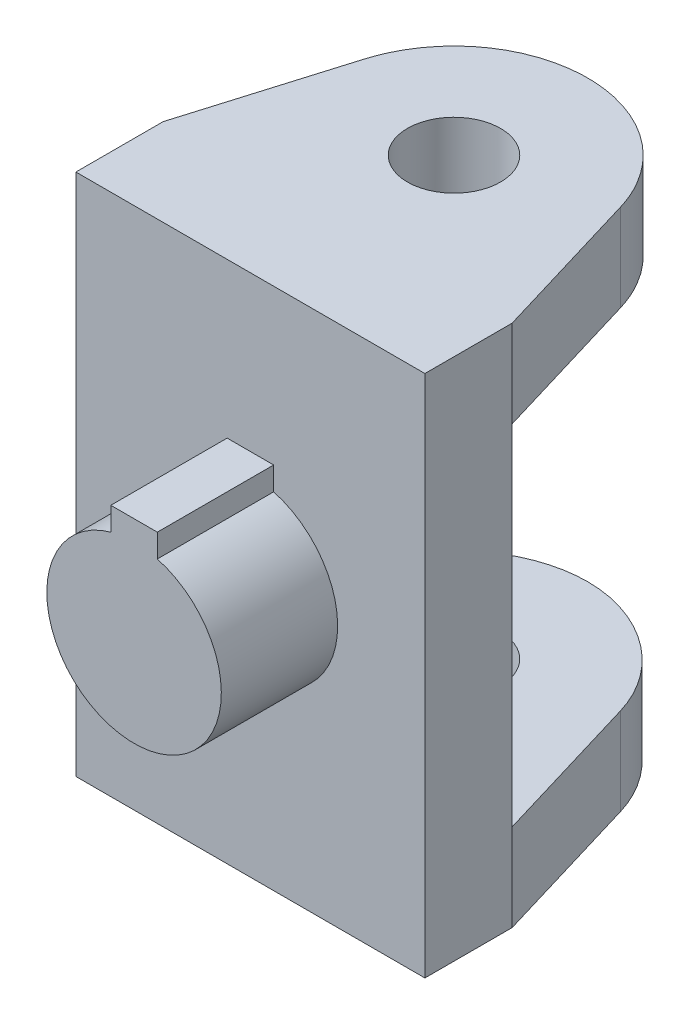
ISO-10303-21;
HEADER;
FILE_DESCRIPTION(('STEP AP214'),'2;1');
FILE_NAME('part.step','',(''),(''),'','','');
FILE_SCHEMA(('AUTOMOTIVE_DESIGN { 1 0 10303 214 1 1 1 1 }'));
ENDSEC;
DATA;
#1=APPLICATION_CONTEXT('core data for automotive mechanical design processes');
#2=APPLICATION_PROTOCOL_DEFINITION('international standard','automotive_design',2000,#1);
#3=PRODUCT_CONTEXT('',#1,'mechanical');
#4=PRODUCT('Part','Part','',(#3));
#5=PRODUCT_RELATED_PRODUCT_CATEGORY('part','',(#4));
#6=PRODUCT_DEFINITION_FORMATION('','',#4);
#7=PRODUCT_DEFINITION_CONTEXT('part definition',#1,'design');
#8=PRODUCT_DEFINITION('design','',#6,#7);
#9=PRODUCT_DEFINITION_SHAPE('','',#8);
#10=(LENGTH_UNIT() NAMED_UNIT(*) SI_UNIT(.MILLI.,.METRE.));
#11=(NAMED_UNIT(*) PLANE_ANGLE_UNIT() SI_UNIT($,.RADIAN.));
#12=(NAMED_UNIT(*) SI_UNIT($,.STERADIAN.) SOLID_ANGLE_UNIT());
#13=UNCERTAINTY_MEASURE_WITH_UNIT(LENGTH_MEASURE(1.E-05),#10,'distance_accuracy_value','');
#14=(GEOMETRIC_REPRESENTATION_CONTEXT(3) GLOBAL_UNCERTAINTY_ASSIGNED_CONTEXT((#13)) GLOBAL_UNIT_ASSIGNED_CONTEXT((#10,
#11,#12)) REPRESENTATION_CONTEXT('',''));
#15=CARTESIAN_POINT('',(0.,0.,0.));
#16=DIRECTION('',(0.,0.,1.));
#17=DIRECTION('',(1.,0.,0.));
#18=AXIS2_PLACEMENT_3D('',#15,#16,#17);
#19=CARTESIAN_POINT('',(-14.9999999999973,11.287192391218,11.4797775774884));
#20=DIRECTION('',(0.,0.,1.));
#21=DIRECTION('',(1.,0.,0.));
#22=AXIS2_PLACEMENT_3D('',#19,#20,#21);
#23=PLANE('',#22);
#24=CARTESIAN_POINT('',(-14.9999999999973,22.537192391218,11.4797775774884));
#25=CARTESIAN_POINT('',(-14.9999999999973,15.037192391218,11.4797775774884));
#26=CARTESIAN_POINT('',(-14.9999999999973,7.53719239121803,11.4797775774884));
#27=CARTESIAN_POINT('',(-14.9999999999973,0.0371923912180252,11.4797775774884));
#28=B_SPLINE_CURVE_WITH_KNOTS('',3,(#24,#25,#26,#27),.UNSPECIFIED.,.F.,.F.,(4,4),(0.,1.),.UNSPECIFIED.);
#29=CARTESIAN_POINT('',(-14.9999999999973,22.537192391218,11.4797775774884));
#30=VERTEX_POINT('',#29);
#31=CARTESIAN_POINT('',(-14.9999999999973,0.0371923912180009,11.4797775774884));
#32=VERTEX_POINT('',#31);
#33=EDGE_CURVE('E343',#30,#32,#28,.T.);
#34=ORIENTED_EDGE('',*,*,#33,.T.);
#35=CARTESIAN_POINT('',(-14.9999999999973,0.0371923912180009,11.4797775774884));
#36=CARTESIAN_POINT('',(-14.9999999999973,-4.962807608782,11.4797775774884));
#37=CARTESIAN_POINT('',(-14.9999999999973,-9.962807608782,11.4797775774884));
#38=CARTESIAN_POINT('',(-14.9999999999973,-14.962807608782,11.4797775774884));
#39=B_SPLINE_CURVE_WITH_KNOTS('',3,(#35,#36,#37,#38),.UNSPECIFIED.,.F.,.F.,(4,4),(0.,1.),.UNSPECIFIED.);
#40=CARTESIAN_POINT('',(-14.9999999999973,-14.962807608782,11.4797775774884));
#41=VERTEX_POINT('',#40);
#42=EDGE_CURVE('E369',#32,#41,#39,.T.);
#43=ORIENTED_EDGE('',*,*,#42,.T.);
#44=DIRECTION('',(0.,1.,0.));
#45=VECTOR('',#44,1.);
#46=CARTESIAN_POINT('',(-14.9999999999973,-22.462807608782,11.4797775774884));
#47=LINE('',#46,#45);
#48=CARTESIAN_POINT('',(-14.9999999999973,-22.462807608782,11.4797775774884));
#49=VERTEX_POINT('',#48);
#50=EDGE_CURVE('E352',#49,#41,#47,.T.);
#51=ORIENTED_EDGE('',*,*,#50,.F.);
#52=CARTESIAN_POINT('',(15.0000000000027,-22.462807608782,11.4797775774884));
#53=CARTESIAN_POINT('',(5.0000000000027,-22.462807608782,11.4797775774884));
#54=CARTESIAN_POINT('',(-4.9999999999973,-22.462807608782,11.4797775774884));
#55=CARTESIAN_POINT('',(-14.9999999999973,-22.462807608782,11.4797775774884));
#56=B_SPLINE_CURVE_WITH_KNOTS('',3,(#52,#53,#54,#55),.UNSPECIFIED.,.F.,.F.,(4,4),(0.,1.),.UNSPECIFIED.);
#57=CARTESIAN_POINT('',(15.0000000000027,-22.462807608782,11.4797775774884));
#58=VERTEX_POINT('',#57);
#59=EDGE_CURVE('E194',#58,#49,#56,.T.);
#60=ORIENTED_EDGE('',*,*,#59,.F.);
#61=DIRECTION('',(0.,1.,0.));
#62=VECTOR('',#61,1.);
#63=CARTESIAN_POINT('',(15.0000000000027,-22.462807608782,11.4797775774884));
#64=LINE('',#63,#62);
#65=CARTESIAN_POINT('',(15.0000000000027,-14.962807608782,11.4797775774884));
#66=VERTEX_POINT('',#65);
#67=EDGE_CURVE('E420',#58,#66,#64,.T.);
#68=ORIENTED_EDGE('',*,*,#67,.T.);
#69=CARTESIAN_POINT('',(15.0000000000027,-14.962807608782,11.4797775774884));
#70=CARTESIAN_POINT('',(15.0000000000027,-9.962807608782,11.4797775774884));
#71=CARTESIAN_POINT('',(15.0000000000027,-4.962807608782,11.4797775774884));
#72=CARTESIAN_POINT('',(15.0000000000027,0.0371923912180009,11.4797775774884));
#73=B_SPLINE_CURVE_WITH_KNOTS('',3,(#69,#70,#71,#72),.UNSPECIFIED.,.F.,.F.,(4,4),(0.,1.),.UNSPECIFIED.);
#74=CARTESIAN_POINT('',(15.0000000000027,0.0371923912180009,11.4797775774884));
#75=VERTEX_POINT('',#74);
#76=EDGE_CURVE('E376',#66,#75,#73,.T.);
#77=ORIENTED_EDGE('',*,*,#76,.T.);
#78=CARTESIAN_POINT('',(15.0000000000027,0.0371923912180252,11.4797775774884));
#79=CARTESIAN_POINT('',(15.0000000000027,7.53719239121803,11.4797775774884));
#80=CARTESIAN_POINT('',(15.0000000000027,15.037192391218,11.4797775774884));
#81=CARTESIAN_POINT('',(15.0000000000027,22.537192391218,11.4797775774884));
#82=B_SPLINE_CURVE_WITH_KNOTS('',3,(#78,#79,#80,#81),.UNSPECIFIED.,.F.,.F.,(4,4),(0.,1.),.UNSPECIFIED.);
#83=CARTESIAN_POINT('',(15.0000000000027,22.537192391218,11.4797775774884));
#84=VERTEX_POINT('',#83);
#85=EDGE_CURVE('E383',#75,#84,#82,.T.);
#86=ORIENTED_EDGE('',*,*,#85,.T.);
#87=CARTESIAN_POINT('',(15.0000000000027,22.537192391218,11.4797775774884));
#88=CARTESIAN_POINT('',(5.0000000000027,22.537192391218,11.4797775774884));
#89=CARTESIAN_POINT('',(-4.9999999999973,22.537192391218,11.4797775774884));
#90=CARTESIAN_POINT('',(-14.9999999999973,22.537192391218,11.4797775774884));
#91=B_SPLINE_CURVE_WITH_KNOTS('',3,(#87,#88,#89,#90),.UNSPECIFIED.,.F.,.F.,(4,4),(0.,1.),.UNSPECIFIED.);
#92=EDGE_CURVE('E390',#84,#30,#91,.T.);
#93=ORIENTED_EDGE('',*,*,#92,.T.);
#94=EDGE_LOOP('',(#34,#43,#51,#60,#68,#77,#86,#93));
#95=FACE_BOUND('',#94,.T.);
#96=DIRECTION('',(0.,1.,0.));
#97=VECTOR('',#96,1.);
#98=CARTESIAN_POINT('',(2.,9.22841614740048,11.4797775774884));
#99=LINE('',#98,#97);
#100=CARTESIAN_POINT('',(2.,7.22841614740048,11.4797775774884));
#101=VERTEX_POINT('',#100);
#102=CARTESIAN_POINT('',(2.,9.22841614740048,11.4797775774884));
#103=VERTEX_POINT('',#102);
#104=EDGE_CURVE('E657',#101,#103,#99,.T.);
#105=ORIENTED_EDGE('',*,*,#104,.F.);
#106=CARTESIAN_POINT('',(0.,0.,11.4797775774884));
#107=DIRECTION('',(0.,0.,1.));
#108=DIRECTION('',(1.,0.,0.));
#109=AXIS2_PLACEMENT_3D('',#106,#107,#108);
#110=CIRCLE('',#109,7.5);
#111=CARTESIAN_POINT('',(-2.,7.22841614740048,11.4797775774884));
#112=VERTEX_POINT('',#111);
#113=EDGE_CURVE('E175',#112,#101,#110,.T.);
#114=ORIENTED_EDGE('',*,*,#113,.F.);
#115=DIRECTION('',(0.,-1.,0.));
#116=VECTOR('',#115,1.);
#117=CARTESIAN_POINT('',(-2.,7.22841614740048,11.4797775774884));
#118=LINE('',#117,#116);
#119=CARTESIAN_POINT('',(-2.,9.22841614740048,11.4797775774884));
#120=VERTEX_POINT('',#119);
#121=EDGE_CURVE('E171',#120,#112,#118,.T.);
#122=ORIENTED_EDGE('',*,*,#121,.F.);
#123=DIRECTION('',(-1.,0.,0.));
#124=VECTOR('',#123,1.);
#125=CARTESIAN_POINT('',(-2.,9.22841614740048,11.4797775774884));
#126=LINE('',#125,#124);
#127=EDGE_CURVE('E654',#103,#120,#126,.T.);
#128=ORIENTED_EDGE('',*,*,#127,.F.);
#129=EDGE_LOOP('',(#105,#114,#122,#128));
#130=FACE_BOUND('',#129,.T.);
#131=ADVANCED_FACE('F33',(#95,#130),#23,.T.);
#132=CARTESIAN_POINT('',(0.0225253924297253,22.537192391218,-17.5202303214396));
#133=DIRECTION('',(0.,-1.,0.));
#134=DIRECTION('',(0.,0.,-1.));
#135=AXIS2_PLACEMENT_3D('',#132,#133,#134);
#136=PLANE('',#135);
#137=CARTESIAN_POINT('',(11.01644918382,22.537192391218,-9.3198962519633));
#138=CARTESIAN_POINT('',(11.0164491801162,22.537192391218,-9.319896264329));
#139=CARTESIAN_POINT('',(11.0164491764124,22.537192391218,-9.3198962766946));
#140=CARTESIAN_POINT('',(10.3065655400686,22.537192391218,-11.68992793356));
#141=CARTESIAN_POINT('',(8.8513296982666,22.537192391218,-13.7678078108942));
#142=CARTESIAN_POINT('',(4.5629984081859,22.537192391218,-16.9599186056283));
#143=CARTESIAN_POINT('',(1.7009850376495,22.537192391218,-17.7507169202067));
#144=CARTESIAN_POINT('',(-3.7842044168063,22.537192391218,-17.1963584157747));
#145=CARTESIAN_POINT('',(-6.24056616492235,22.537192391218,-16.034290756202));
#146=CARTESIAN_POINT('',(-9.46916921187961,22.537192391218,-12.8208343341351));
#147=CARTESIAN_POINT('',(-10.4672628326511,22.537192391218,-11.1534165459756));
#148=CARTESIAN_POINT('',(-11.0164474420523,22.537192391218,-9.3198957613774));
#149=CARTESIAN_POINT('',(-11.0164474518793,22.537192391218,-9.3198957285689));
#150=CARTESIAN_POINT('',(-11.0164474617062,22.537192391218,-9.3198956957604));
#151=B_SPLINE_CURVE_WITH_KNOTS('',3,(#137,#138,#139,#140,#141,#142,#143,#144,#145,#146,#147,
#148,#149,#150),.UNSPECIFIED.,.F.,.F.,(4,2,2,2,2,2,4),(0.,2.E-08,3.83324331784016,
8.2828763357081,12.3751179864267,15.3406150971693,15.3406151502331),.UNSPECIFIED.);
#152=CARTESIAN_POINT('',(11.01644918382,22.537192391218,-9.31989625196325));
#153=VERTEX_POINT('',#152);
#154=CARTESIAN_POINT('',(-11.0164474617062,22.537192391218,-9.3198956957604));
#155=VERTEX_POINT('',#154);
#156=EDGE_CURVE('E276',#153,#155,#151,.T.);
#157=ORIENTED_EDGE('',*,*,#156,.T.);
#158=CARTESIAN_POINT('',(-11.0164474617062,22.537192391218,-9.3198956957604));
#159=CARTESIAN_POINT('',(-12.3443029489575,22.537192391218,-4.886672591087));
#160=CARTESIAN_POINT('',(-13.6721514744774,22.537192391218,-0.4534475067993));
#161=CARTESIAN_POINT('',(-14.9999999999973,22.537192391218,3.9797775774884));
#162=B_SPLINE_CURVE_WITH_KNOTS('',3,(#158,#159,#160,#161),.UNSPECIFIED.,.F.,.F.,(4,4),(0.,1.),.UNSPECIFIED.);
#163=CARTESIAN_POINT('',(-14.9999999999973,22.537192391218,3.9797775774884));
#164=VERTEX_POINT('',#163);
#165=EDGE_CURVE('E271',#155,#164,#162,.T.);
#166=ORIENTED_EDGE('',*,*,#165,.T.);
#167=DIRECTION('',(0.,0.,-1.));
#168=VECTOR('',#167,1.);
#169=CARTESIAN_POINT('',(-14.9999999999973,22.537192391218,11.4797775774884));
#170=LINE('',#169,#168);
#171=EDGE_CURVE('E397',#30,#164,#170,.T.);
#172=ORIENTED_EDGE('',*,*,#171,.F.);
#173=ORIENTED_EDGE('',*,*,#92,.F.);
#174=DIRECTION('',(0.,0.,-1.));
#175=VECTOR('',#174,1.);
#176=CARTESIAN_POINT('',(15.0000000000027,22.537192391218,11.4797775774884));
#177=LINE('',#176,#175);
#178=CARTESIAN_POINT('',(15.0000000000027,22.537192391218,3.97977757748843));
#179=VERTEX_POINT('',#178);
#180=EDGE_CURVE('E297',#84,#179,#177,.T.);
#181=ORIENTED_EDGE('',*,*,#180,.T.);
#182=CARTESIAN_POINT('',(15.0000000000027,22.537192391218,3.97977757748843));
#183=CARTESIAN_POINT('',(13.6721497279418,22.537192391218,-0.453447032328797));
#184=CARTESIAN_POINT('',(12.3442994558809,22.537192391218,-4.88667164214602));
#185=CARTESIAN_POINT('',(11.01644918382,22.537192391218,-9.31989625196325));
#186=B_SPLINE_CURVE_WITH_KNOTS('',3,(#182,#183,#184,#185),.UNSPECIFIED.,.F.,.F.,(4,4),(0.,1.),.UNSPECIFIED.);
#187=EDGE_CURVE('E61',#179,#153,#186,.T.);
#188=ORIENTED_EDGE('',*,*,#187,.T.);
#189=EDGE_LOOP('',(#157,#166,#172,#173,#181,#188));
#190=FACE_BOUND('',#189,.T.);
#191=CARTESIAN_POINT('',(2.07852425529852E-11,22.537192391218,-6.02022242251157));
#192=DIRECTION('',(0.,1.,0.));
#193=DIRECTION('',(0.,0.,1.));
#194=AXIS2_PLACEMENT_3D('',#191,#192,#193);
#195=CIRCLE('',#194,3.99999999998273);
#196=CARTESIAN_POINT('',(2.07852425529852E-11,22.537192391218,-2.02022242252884));
#197=VERTEX_POINT('',#196);
#198=EDGE_CURVE('E177',#197,#197,#195,.T.);
#199=ORIENTED_EDGE('',*,*,#198,.F.);
#200=EDGE_LOOP('',(#199));
#201=FACE_BOUND('',#200,.T.);
#202=ADVANCED_FACE('F249',(#190,#201),#136,.F.);
#203=CARTESIAN_POINT('',(0.0225253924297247,15.037192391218,-17.5202303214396));
#204=DIRECTION('',(0.,-1.,0.));
#205=DIRECTION('',(0.,0.,-1.));
#206=AXIS2_PLACEMENT_3D('',#203,#204,#205);
#207=PLANE('',#206);
#208=CARTESIAN_POINT('',(2.07852425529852E-11,15.037192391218,-6.02022242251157));
#209=DIRECTION('',(0.,-1.,0.));
#210=DIRECTION('',(0.,0.,-1.));
#211=AXIS2_PLACEMENT_3D('',#208,#209,#210);
#212=CIRCLE('',#211,3.99999999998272);
#213=CARTESIAN_POINT('',(2.07852425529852E-11,15.037192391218,-10.0202224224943));
#214=VERTEX_POINT('',#213);
#215=EDGE_CURVE('E180',#214,#214,#212,.T.);
#216=ORIENTED_EDGE('',*,*,#215,.F.);
#217=EDGE_LOOP('',(#216));
#218=FACE_BOUND('',#217,.T.);
#219=CARTESIAN_POINT('',(11.01644918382,15.037192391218,-9.3198962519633));
#220=CARTESIAN_POINT('',(11.0164491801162,15.037192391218,-9.319896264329));
#221=CARTESIAN_POINT('',(11.0164491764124,15.037192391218,-9.3198962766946));
#222=CARTESIAN_POINT('',(10.3065655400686,15.037192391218,-11.68992793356));
#223=CARTESIAN_POINT('',(8.8513296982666,15.037192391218,-13.7678078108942));
#224=CARTESIAN_POINT('',(4.5629984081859,15.037192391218,-16.9599186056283));
#225=CARTESIAN_POINT('',(1.7009850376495,15.037192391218,-17.7507169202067));
#226=CARTESIAN_POINT('',(-3.7842044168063,15.037192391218,-17.1963584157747));
#227=CARTESIAN_POINT('',(-6.24056616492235,15.037192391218,-16.034290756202));
#228=CARTESIAN_POINT('',(-9.46916921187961,15.037192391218,-12.8208343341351));
#229=CARTESIAN_POINT('',(-10.4672628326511,15.037192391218,-11.1534165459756));
#230=CARTESIAN_POINT('',(-11.0164474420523,15.037192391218,-9.3198957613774));
#231=CARTESIAN_POINT('',(-11.0164474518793,15.037192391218,-9.3198957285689));
#232=CARTESIAN_POINT('',(-11.0164474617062,15.037192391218,-9.3198956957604));
#233=B_SPLINE_CURVE_WITH_KNOTS('',3,(#219,#220,#221,#222,#223,#224,#225,#226,#227,#228,#229,
#230,#231,#232),.UNSPECIFIED.,.F.,.F.,(4,2,2,2,2,2,4),(0.,2.E-08,3.83324331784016,
8.2828763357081,12.3751179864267,15.3406150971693,15.3406151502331),.UNSPECIFIED.);
#234=CARTESIAN_POINT('',(11.0164493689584,15.037192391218,-9.31989563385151));
#235=VERTEX_POINT('',#234);
#236=CARTESIAN_POINT('',(-11.0164474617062,15.037192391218,-9.3198956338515));
#237=VERTEX_POINT('',#236);
#238=EDGE_CURVE('E288',#235,#237,#233,.T.);
#239=ORIENTED_EDGE('',*,*,#238,.F.);
#240=CARTESIAN_POINT('',(15.0000000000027,15.037192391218,3.97977757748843));
#241=CARTESIAN_POINT('',(13.6721497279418,15.037192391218,-0.453447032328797));
#242=CARTESIAN_POINT('',(12.3442994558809,15.037192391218,-4.88667164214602));
#243=CARTESIAN_POINT('',(11.01644918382,15.037192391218,-9.31989625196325));
#244=B_SPLINE_CURVE_WITH_KNOTS('',3,(#240,#241,#242,#243),.UNSPECIFIED.,.F.,.F.,(4,4),(0.,1.),.UNSPECIFIED.);
#245=CARTESIAN_POINT('',(15.0000000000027,15.037192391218,3.97977757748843));
#246=VERTEX_POINT('',#245);
#247=EDGE_CURVE('E310',#246,#235,#244,.T.);
#248=ORIENTED_EDGE('',*,*,#247,.F.);
#249=CARTESIAN_POINT('',(-14.9999999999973,15.037192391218,3.97977757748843));
#250=CARTESIAN_POINT('',(-4.9999999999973,15.037192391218,3.97977757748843));
#251=CARTESIAN_POINT('',(5.0000000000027,15.037192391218,3.97977757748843));
#252=CARTESIAN_POINT('',(15.0000000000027,15.037192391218,3.97977757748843));
#253=B_SPLINE_CURVE_WITH_KNOTS('',3,(#249,#250,#251,#252),.UNSPECIFIED.,.F.,.F.,(4,4),(0.,1.),.UNSPECIFIED.);
#254=CARTESIAN_POINT('',(-14.9999999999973,15.037192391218,3.97977757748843));
#255=VERTEX_POINT('',#254);
#256=EDGE_CURVE('E332',#255,#246,#253,.T.);
#257=ORIENTED_EDGE('',*,*,#256,.F.);
#258=CARTESIAN_POINT('',(-11.0164474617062,15.037192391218,-9.3198956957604));
#259=CARTESIAN_POINT('',(-12.3443029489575,15.037192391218,-4.886672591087));
#260=CARTESIAN_POINT('',(-13.6721514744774,15.037192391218,-0.4534475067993));
#261=CARTESIAN_POINT('',(-14.9999999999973,15.037192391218,3.9797775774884));
#262=B_SPLINE_CURVE_WITH_KNOTS('',3,(#258,#259,#260,#261),.UNSPECIFIED.,.F.,.F.,(4,4),(0.,1.),.UNSPECIFIED.);
#263=EDGE_CURVE('E296',#237,#255,#262,.T.);
#264=ORIENTED_EDGE('',*,*,#263,.F.);
#265=EDGE_LOOP('',(#239,#248,#257,#264));
#266=FACE_BOUND('',#265,.T.);
#267=ADVANCED_FACE('F261',(#218,#266),#207,.T.);
#268=DIRECTION('',(0.,-1.,0.));
#269=VECTOR('',#268,1.);
#270=SURFACE_OF_LINEAR_EXTRUSION('',#151,#269);
#271=ORIENTED_EDGE('',*,*,#238,.T.);
#272=DIRECTION('',(0.,-1.,0.));
#273=VECTOR('',#272,1.);
#274=CARTESIAN_POINT('',(-11.0164474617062,22.537192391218,-9.3198956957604));
#275=LINE('',#274,#273);
#276=EDGE_CURVE('E11',#155,#237,#275,.T.);
#277=ORIENTED_EDGE('',*,*,#276,.F.);
#278=ORIENTED_EDGE('',*,*,#156,.F.);
#279=DIRECTION('',(0.,-1.,0.));
#280=VECTOR('',#279,1.);
#281=CARTESIAN_POINT('',(11.01644918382,22.537192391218,-9.31989625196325));
#282=LINE('',#281,#280);
#283=EDGE_CURVE('E287',#153,#235,#282,.T.);
#284=ORIENTED_EDGE('',*,*,#283,.T.);
#285=EDGE_LOOP('',(#271,#277,#278,#284));
#286=FACE_BOUND('',#285,.T.);
#287=ADVANCED_FACE('F35',(#286),#270,.F.);
#288=DIRECTION('',(0.,-1.,0.));
#289=VECTOR('',#288,1.);
#290=SURFACE_OF_LINEAR_EXTRUSION('',#162,#289);
#291=ORIENTED_EDGE('',*,*,#263,.T.);
#292=DIRECTION('',(0.,-1.,0.));
#293=VECTOR('',#292,1.);
#294=CARTESIAN_POINT('',(-14.9999999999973,22.537192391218,3.9797775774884));
#295=LINE('',#294,#293);
#296=EDGE_CURVE('E45',#164,#255,#295,.T.);
#297=ORIENTED_EDGE('',*,*,#296,.F.);
#298=ORIENTED_EDGE('',*,*,#165,.F.);
#299=ORIENTED_EDGE('',*,*,#276,.T.);
#300=EDGE_LOOP('',(#291,#297,#298,#299));
#301=FACE_BOUND('',#300,.T.);
#302=ADVANCED_FACE('F266',(#301),#290,.F.);
#303=CARTESIAN_POINT('',(15.0000000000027,22.537192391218,3.97977757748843));
#304=DIRECTION('',(-0.957952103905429,0.,0.286928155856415));
#305=DIRECTION('',(0.286928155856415,0.,0.957952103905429));
#306=AXIS2_PLACEMENT_3D('',#303,#304,#305);
#307=PLANE('',#306);
#308=ORIENTED_EDGE('',*,*,#247,.T.);
#309=ORIENTED_EDGE('',*,*,#283,.F.);
#310=ORIENTED_EDGE('',*,*,#187,.F.);
#311=DIRECTION('',(0.,-1.,0.));
#312=VECTOR('',#311,1.);
#313=CARTESIAN_POINT('',(15.0000000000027,22.537192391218,3.97977757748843));
#314=LINE('',#313,#312);
#315=EDGE_CURVE('E302',#179,#246,#314,.T.);
#316=ORIENTED_EDGE('',*,*,#315,.T.);
#317=EDGE_LOOP('',(#308,#309,#310,#316));
#318=FACE_BOUND('',#317,.T.);
#319=ADVANCED_FACE('F257',(#318),#307,.F.);
#320=CARTESIAN_POINT('',(15.0000000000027,0.0371923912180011,-9.31989563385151));
#321=DIRECTION('',(-1.,0.,0.));
#322=DIRECTION('',(0.,0.,1.));
#323=AXIS2_PLACEMENT_3D('',#320,#321,#322);
#324=PLANE('',#323);
#325=ORIENTED_EDGE('',*,*,#76,.F.);
#326=ORIENTED_EDGE('',*,*,#67,.F.);
#327=CARTESIAN_POINT('',(15.0000000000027,-22.462807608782,3.9797775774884));
#328=CARTESIAN_POINT('',(15.0000000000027,-22.462807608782,6.4797775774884));
#329=CARTESIAN_POINT('',(15.0000000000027,-22.462807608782,8.9797775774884));
#330=CARTESIAN_POINT('',(15.0000000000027,-22.462807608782,11.4797775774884));
#331=B_SPLINE_CURVE_WITH_KNOTS('',3,(#327,#328,#329,#330),.UNSPECIFIED.,.F.,.F.,(4,4),(0.,1.),.UNSPECIFIED.);
#332=CARTESIAN_POINT('',(15.0000000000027,-22.462807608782,3.9797775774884));
#333=VERTEX_POINT('',#332);
#334=EDGE_CURVE('E422',#333,#58,#331,.T.);
#335=ORIENTED_EDGE('',*,*,#334,.F.);
#336=DIRECTION('',(0.,1.,0.));
#337=VECTOR('',#336,1.);
#338=CARTESIAN_POINT('',(15.0000000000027,-22.462807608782,3.9797775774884));
#339=LINE('',#338,#337);
#340=CARTESIAN_POINT('',(15.0000000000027,-14.962807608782,3.9797775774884));
#341=VERTEX_POINT('',#340);
#342=EDGE_CURVE('E423',#333,#341,#339,.T.);
#343=ORIENTED_EDGE('',*,*,#342,.T.);
#344=CARTESIAN_POINT('',(15.0000000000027,15.037192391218,3.97977757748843));
#345=CARTESIAN_POINT('',(15.0000000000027,5.037192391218,3.97977757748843));
#346=CARTESIAN_POINT('',(15.0000000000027,-4.962807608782,3.97977757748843));
#347=CARTESIAN_POINT('',(15.0000000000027,-14.962807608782,3.97977757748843));
#348=B_SPLINE_CURVE_WITH_KNOTS('',3,(#344,#345,#346,#347),.UNSPECIFIED.,.F.,.F.,(4,4),(0.,1.),.UNSPECIFIED.);
#349=EDGE_CURVE('E347',#246,#341,#348,.T.);
#350=ORIENTED_EDGE('',*,*,#349,.F.);
#351=ORIENTED_EDGE('',*,*,#315,.F.);
#352=ORIENTED_EDGE('',*,*,#180,.F.);
#353=ORIENTED_EDGE('',*,*,#85,.F.);
#354=EDGE_LOOP('',(#325,#326,#335,#343,#350,#351,#352,#353));
#355=FACE_BOUND('',#354,.T.);
#356=ADVANCED_FACE('F253',(#355),#324,.F.);
#357=CARTESIAN_POINT('',(-14.9999999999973,0.0371923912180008,-9.31989563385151));
#358=DIRECTION('',(1.,0.,0.));
#359=DIRECTION('',(0.,0.,-1.));
#360=AXIS2_PLACEMENT_3D('',#357,#358,#359);
#361=PLANE('',#360);
#362=ORIENTED_EDGE('',*,*,#296,.T.);
#363=CARTESIAN_POINT('',(-14.9999999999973,-14.962807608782,3.97977757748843));
#364=CARTESIAN_POINT('',(-14.9999999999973,-4.962807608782,3.97977757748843));
#365=CARTESIAN_POINT('',(-14.9999999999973,5.037192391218,3.97977757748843));
#366=CARTESIAN_POINT('',(-14.9999999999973,15.037192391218,3.97977757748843));
#367=B_SPLINE_CURVE_WITH_KNOTS('',3,(#363,#364,#365,#366),.UNSPECIFIED.,.F.,.F.,(4,4),(0.,1.),.UNSPECIFIED.);
#368=CARTESIAN_POINT('',(-14.9999999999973,-14.962807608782,3.97977757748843));
#369=VERTEX_POINT('',#368);
#370=EDGE_CURVE('E330',#369,#255,#367,.T.);
#371=ORIENTED_EDGE('',*,*,#370,.F.);
#372=DIRECTION('',(0.,1.,0.));
#373=VECTOR('',#372,1.);
#374=CARTESIAN_POINT('',(-14.9999999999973,-22.462807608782,3.97977757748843));
#375=LINE('',#374,#373);
#376=CARTESIAN_POINT('',(-14.9999999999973,-22.462807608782,3.97977757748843));
#377=VERTEX_POINT('',#376);
#378=EDGE_CURVE('E356',#377,#369,#375,.T.);
#379=ORIENTED_EDGE('',*,*,#378,.F.);
#380=CARTESIAN_POINT('',(-14.9999999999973,-22.462807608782,11.4797775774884));
#381=CARTESIAN_POINT('',(-14.9999999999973,-22.462807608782,8.97977757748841));
#382=CARTESIAN_POINT('',(-14.9999999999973,-22.462807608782,6.47977757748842));
#383=CARTESIAN_POINT('',(-14.9999999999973,-22.462807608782,3.97977757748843));
#384=B_SPLINE_CURVE_WITH_KNOTS('',3,(#380,#381,#382,#383),.UNSPECIFIED.,.F.,.F.,(4,4),(0.,1.),.UNSPECIFIED.);
#385=EDGE_CURVE('E199',#49,#377,#384,.T.);
#386=ORIENTED_EDGE('',*,*,#385,.F.);
#387=ORIENTED_EDGE('',*,*,#50,.T.);
#388=ORIENTED_EDGE('',*,*,#42,.F.);
#389=ORIENTED_EDGE('',*,*,#33,.F.);
#390=ORIENTED_EDGE('',*,*,#171,.T.);
#391=EDGE_LOOP('',(#362,#371,#379,#386,#387,#388,#389,#390));
#392=FACE_BOUND('',#391,.T.);
#393=ADVANCED_FACE('F245',(#392),#361,.F.);
#394=CARTESIAN_POINT('',(15.0000000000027,0.0371923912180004,3.97977757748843));
#395=DIRECTION('',(0.,0.,1.));
#396=DIRECTION('',(1.,0.,0.));
#397=AXIS2_PLACEMENT_3D('',#394,#395,#396);
#398=PLANE('',#397);
#399=ORIENTED_EDGE('',*,*,#349,.T.);
#400=DIRECTION('',(-1.,0.,0.));
#401=VECTOR('',#400,1.);
#402=CARTESIAN_POINT('',(15.0000000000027,-14.962807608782,3.97977757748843));
#403=LINE('',#402,#401);
#404=EDGE_CURVE('E333',#341,#369,#403,.T.);
#405=ORIENTED_EDGE('',*,*,#404,.T.);
#406=ORIENTED_EDGE('',*,*,#370,.T.);
#407=ORIENTED_EDGE('',*,*,#256,.T.);
#408=EDGE_LOOP('',(#399,#405,#406,#407));
#409=FACE_BOUND('',#408,.T.);
#410=ADVANCED_FACE('F241',(#409),#398,.F.);
#411=CARTESIAN_POINT('',(-14.9999999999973,-22.462807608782,3.9797775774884));
#412=DIRECTION('',(0.957952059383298,0.,0.286928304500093));
#413=DIRECTION('',(0.286928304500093,0.,-0.957952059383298));
#414=AXIS2_PLACEMENT_3D('',#411,#412,#413);
#415=PLANE('',#414);
#416=CARTESIAN_POINT('',(-14.9999999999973,-14.962807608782,3.9797775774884));
#417=CARTESIAN_POINT('',(-13.6721518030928,-14.962807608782,-0.4534476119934));
#418=CARTESIAN_POINT('',(-12.3443036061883,-14.962807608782,-4.8866728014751));
#419=CARTESIAN_POINT('',(-11.0164471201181,-14.962807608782,-9.31989563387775));
#420=B_SPLINE_CURVE_WITH_KNOTS('',3,(#416,#417,#418,#419),.UNSPECIFIED.,.F.,.F.,(4,4),(0.,1.),.UNSPECIFIED.);
#421=CARTESIAN_POINT('',(-11.0164471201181,-14.962807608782,-9.31989563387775));
#422=VERTEX_POINT('',#421);
#423=EDGE_CURVE('E193',#369,#422,#420,.T.);
#424=ORIENTED_EDGE('',*,*,#423,.T.);
#425=DIRECTION('',(0.,1.,0.));
#426=VECTOR('',#425,1.);
#427=CARTESIAN_POINT('',(-11.0164471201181,-22.462807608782,-9.31989563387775));
#428=LINE('',#427,#426);
#429=CARTESIAN_POINT('',(-11.0164471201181,-22.462807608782,-9.31989563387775));
#430=VERTEX_POINT('',#429);
#431=EDGE_CURVE('E361',#430,#422,#428,.T.);
#432=ORIENTED_EDGE('',*,*,#431,.F.);
#433=CARTESIAN_POINT('',(-14.9999999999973,-22.462807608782,3.9797775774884));
#434=CARTESIAN_POINT('',(-13.6721518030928,-22.462807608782,-0.4534476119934));
#435=CARTESIAN_POINT('',(-12.3443036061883,-22.462807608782,-4.8866728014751));
#436=CARTESIAN_POINT('',(-11.0164471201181,-22.462807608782,-9.31989563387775));
#437=B_SPLINE_CURVE_WITH_KNOTS('',3,(#433,#434,#435,#436),.UNSPECIFIED.,.F.,.F.,(4,4),(0.,1.),.UNSPECIFIED.);
#438=EDGE_CURVE('E207',#377,#430,#437,.T.);
#439=ORIENTED_EDGE('',*,*,#438,.F.);
#440=ORIENTED_EDGE('',*,*,#378,.T.);
#441=EDGE_LOOP('',(#424,#432,#439,#440));
#442=FACE_BOUND('',#441,.T.);
#443=ADVANCED_FACE('F236',(#442),#415,.F.);
#444=CARTESIAN_POINT('',(-11.0164471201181,-22.462807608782,-9.31989563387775));
#445=CARTESIAN_POINT('',(-9.59597274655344,-22.462807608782,-14.0623197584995));
#446=CARTESIAN_POINT('',(-4.93185832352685,-22.462807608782,-17.510714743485));
#447=CARTESIAN_POINT('',(4.88680957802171,-22.462807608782,-17.5297453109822));
#448=CARTESIAN_POINT('',(9.59597408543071,-22.462807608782,-14.0623257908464));
#449=CARTESIAN_POINT('',(11.0164474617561,-22.462807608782,-9.31989569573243));
#450=B_SPLINE_CURVE_WITH_KNOTS('',3,(#444,#445,#446,#447,#448,#449),.UNSPECIFIED.,.F.,.F.,(4,2,
4),(0.,0.5,1.),.UNSPECIFIED.);
#451=DIRECTION('',(0.,1.,0.));
#452=VECTOR('',#451,1.);
#453=SURFACE_OF_LINEAR_EXTRUSION('',#450,#452);
#454=CARTESIAN_POINT('',(-11.0164471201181,-14.962807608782,-9.31989563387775));
#455=CARTESIAN_POINT('',(-9.59597274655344,-14.962807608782,-14.0623197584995));
#456=CARTESIAN_POINT('',(-4.93185832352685,-14.962807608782,-17.510714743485));
#457=CARTESIAN_POINT('',(4.88680957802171,-14.962807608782,-17.5297453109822));
#458=CARTESIAN_POINT('',(9.59597408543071,-14.962807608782,-14.0623257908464));
#459=CARTESIAN_POINT('',(11.0164474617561,-14.962807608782,-9.31989569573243));
#460=B_SPLINE_CURVE_WITH_KNOTS('',3,(#454,#455,#456,#457,#458,#459),.UNSPECIFIED.,.F.,.F.,(4,2,
4),(0.,0.5,1.),.UNSPECIFIED.);
#461=CARTESIAN_POINT('',(11.0164474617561,-14.962807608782,-9.31989569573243));
#462=VERTEX_POINT('',#461);
#463=EDGE_CURVE('E439',#422,#462,#460,.T.);
#464=ORIENTED_EDGE('',*,*,#463,.T.);
#465=DIRECTION('',(0.,1.,0.));
#466=VECTOR('',#465,1.);
#467=CARTESIAN_POINT('',(11.0164474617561,-22.462807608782,-9.31989569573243));
#468=LINE('',#467,#466);
#469=CARTESIAN_POINT('',(11.0164474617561,-22.462807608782,-9.31989569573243));
#470=VERTEX_POINT('',#469);
#471=EDGE_CURVE('E457',#470,#462,#468,.T.);
#472=ORIENTED_EDGE('',*,*,#471,.F.);
#473=EDGE_CURVE('E214',#430,#470,#450,.T.);
#474=ORIENTED_EDGE('',*,*,#473,.F.);
#475=ORIENTED_EDGE('',*,*,#431,.T.);
#476=EDGE_LOOP('',(#464,#472,#474,#475));
#477=FACE_BOUND('',#476,.T.);
#478=ADVANCED_FACE('F231',(#477),#453,.F.);
#479=CARTESIAN_POINT('',(11.0164474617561,-22.462807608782,-9.31989569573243));
#480=CARTESIAN_POINT('',(12.3443029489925,-22.462807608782,-4.8866725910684));
#481=CARTESIAN_POINT('',(13.6721514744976,-22.462807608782,-0.453447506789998));
#482=CARTESIAN_POINT('',(15.0000000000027,-22.462807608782,3.9797775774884));
#483=B_SPLINE_CURVE_WITH_KNOTS('',3,(#479,#480,#481,#482),.UNSPECIFIED.,.F.,.F.,(4,4),(0.,1.),.UNSPECIFIED.);
#484=DIRECTION('',(0.,1.,0.));
#485=VECTOR('',#484,1.);
#486=SURFACE_OF_LINEAR_EXTRUSION('',#483,#485);
#487=CARTESIAN_POINT('',(11.0164474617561,-14.962807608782,-9.31989569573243));
#488=CARTESIAN_POINT('',(12.3443029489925,-14.962807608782,-4.8866725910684));
#489=CARTESIAN_POINT('',(13.6721514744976,-14.962807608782,-0.453447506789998));
#490=CARTESIAN_POINT('',(15.0000000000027,-14.962807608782,3.9797775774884));
#491=B_SPLINE_CURVE_WITH_KNOTS('',3,(#487,#488,#489,#490),.UNSPECIFIED.,.F.,.F.,(4,4),(0.,1.),.UNSPECIFIED.);
#492=EDGE_CURVE('E200',#462,#341,#491,.T.);
#493=ORIENTED_EDGE('',*,*,#492,.T.);
#494=ORIENTED_EDGE('',*,*,#342,.F.);
#495=EDGE_CURVE('E222',#470,#333,#483,.T.);
#496=ORIENTED_EDGE('',*,*,#495,.F.);
#497=ORIENTED_EDGE('',*,*,#471,.T.);
#498=EDGE_LOOP('',(#493,#494,#496,#497));
#499=FACE_BOUND('',#498,.T.);
#500=ADVANCED_FACE('F235',(#499),#486,.F.);
#501=CARTESIAN_POINT('',(-0.0225243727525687,-22.462807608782,-17.5202300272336));
#502=DIRECTION('',(0.,-1.,0.));
#503=DIRECTION('',(0.,0.,-1.));
#504=AXIS2_PLACEMENT_3D('',#501,#502,#503);
#505=PLANE('',#504);
#506=CARTESIAN_POINT('',(2.07852425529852E-11,-22.462807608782,-6.02022242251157));
#507=DIRECTION('',(0.,-1.,0.));
#508=DIRECTION('',(0.,0.,-1.));
#509=AXIS2_PLACEMENT_3D('',#506,#507,#508);
#510=CIRCLE('',#509,3.99999999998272);
#511=CARTESIAN_POINT('',(2.07852425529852E-11,-22.462807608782,-10.0202224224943));
#512=VERTEX_POINT('',#511);
#513=EDGE_CURVE('E187',#512,#512,#510,.T.);
#514=ORIENTED_EDGE('',*,*,#513,.F.);
#515=EDGE_LOOP('',(#514));
#516=FACE_BOUND('',#515,.T.);
#517=ORIENTED_EDGE('',*,*,#59,.T.);
#518=ORIENTED_EDGE('',*,*,#385,.T.);
#519=ORIENTED_EDGE('',*,*,#438,.T.);
#520=ORIENTED_EDGE('',*,*,#473,.T.);
#521=ORIENTED_EDGE('',*,*,#495,.T.);
#522=ORIENTED_EDGE('',*,*,#334,.T.);
#523=EDGE_LOOP('',(#517,#518,#519,#520,#521,#522));
#524=FACE_BOUND('',#523,.T.);
#525=ADVANCED_FACE('F426',(#516,#524),#505,.T.);
#526=CARTESIAN_POINT('',(-0.0225243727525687,-14.962807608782,-17.5202300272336));
#527=DIRECTION('',(0.,-1.,0.));
#528=DIRECTION('',(0.,0.,-1.));
#529=AXIS2_PLACEMENT_3D('',#526,#527,#528);
#530=PLANE('',#529);
#531=CARTESIAN_POINT('',(2.07852425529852E-11,-14.962807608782,-6.02022242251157));
#532=DIRECTION('',(0.,-1.,0.));
#533=DIRECTION('',(0.,0.,-1.));
#534=AXIS2_PLACEMENT_3D('',#531,#532,#533);
#535=CIRCLE('',#534,3.99999999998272);
#536=CARTESIAN_POINT('',(2.07852425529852E-11,-14.962807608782,-10.0202224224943));
#537=VERTEX_POINT('',#536);
#538=EDGE_CURVE('E190',#537,#537,#535,.T.);
#539=ORIENTED_EDGE('',*,*,#538,.T.);
#540=EDGE_LOOP('',(#539));
#541=FACE_BOUND('',#540,.T.);
#542=ORIENTED_EDGE('',*,*,#404,.F.);
#543=ORIENTED_EDGE('',*,*,#492,.F.);
#544=ORIENTED_EDGE('',*,*,#463,.F.);
#545=ORIENTED_EDGE('',*,*,#423,.F.);
#546=EDGE_LOOP('',(#542,#543,#544,#545));
#547=FACE_BOUND('',#546,.T.);
#548=ADVANCED_FACE('F467',(#541,#547),#530,.F.);
#549=CARTESIAN_POINT('',(2.07852425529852E-11,-22.462807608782,-6.02022242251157));
#550=DIRECTION('',(0.,-1.,0.));
#551=DIRECTION('',(0.,0.,-1.));
#552=AXIS2_PLACEMENT_3D('',#549,#550,#551);
#553=CYLINDRICAL_SURFACE('',#552,3.99999999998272);
#554=ORIENTED_EDGE('',*,*,#538,.F.);
#555=EDGE_LOOP('',(#554));
#556=FACE_BOUND('',#555,.T.);
#557=ORIENTED_EDGE('',*,*,#513,.T.);
#558=EDGE_LOOP('',(#557));
#559=FACE_BOUND('',#558,.T.);
#560=ADVANCED_FACE('F478',(#556,#559),#553,.F.);
#561=CARTESIAN_POINT('',(2.07852425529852E-11,22.537192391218,-6.02022242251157));
#562=DIRECTION('',(0.,1.,0.));
#563=DIRECTION('',(0.,0.,1.));
#564=AXIS2_PLACEMENT_3D('',#561,#562,#563);
#565=CYLINDRICAL_SURFACE('',#564,3.99999999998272);
#566=ORIENTED_EDGE('',*,*,#215,.T.);
#567=EDGE_LOOP('',(#566));
#568=FACE_BOUND('',#567,.T.);
#569=ORIENTED_EDGE('',*,*,#198,.T.);
#570=EDGE_LOOP('',(#569));
#571=FACE_BOUND('',#570,.T.);
#572=ADVANCED_FACE('F484',(#568,#571),#565,.F.);
#573=CARTESIAN_POINT('',(0.,0.,21.4797775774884));
#574=DIRECTION('',(0.,0.,-1.));
#575=DIRECTION('',(-1.,0.,0.));
#576=AXIS2_PLACEMENT_3D('',#573,#574,#575);
#577=CYLINDRICAL_SURFACE('',#576,7.5);
#578=ORIENTED_EDGE('',*,*,#113,.T.);
#579=DIRECTION('',(0.,0.,-1.));
#580=VECTOR('',#579,1.);
#581=CARTESIAN_POINT('',(2.,7.22841614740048,21.4797775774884));
#582=LINE('',#581,#580);
#583=CARTESIAN_POINT('',(2.,7.22841614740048,21.4797775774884));
#584=VERTEX_POINT('',#583);
#585=EDGE_CURVE('E156',#584,#101,#582,.T.);
#586=ORIENTED_EDGE('',*,*,#585,.F.);
#587=CARTESIAN_POINT('',(0.,0.,21.4797775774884));
#588=DIRECTION('',(0.,0.,1.));
#589=DIRECTION('',(1.,0.,0.));
#590=AXIS2_PLACEMENT_3D('',#587,#588,#589);
#591=CIRCLE('',#590,7.5);
#592=CARTESIAN_POINT('',(-2.,7.22841614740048,21.4797775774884));
#593=VERTEX_POINT('',#592);
#594=EDGE_CURVE('E163',#593,#584,#591,.T.);
#595=ORIENTED_EDGE('',*,*,#594,.F.);
#596=DIRECTION('',(0.,0.,-1.));
#597=VECTOR('',#596,1.);
#598=CARTESIAN_POINT('',(-2.,7.22841614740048,21.4797775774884));
#599=LINE('',#598,#597);
#600=EDGE_CURVE('E652',#593,#112,#599,.T.);
#601=ORIENTED_EDGE('',*,*,#600,.T.);
#602=EDGE_LOOP('',(#578,#586,#595,#601));
#603=FACE_BOUND('',#602,.T.);
#604=ADVANCED_FACE('F173',(#603),#577,.T.);
#605=CARTESIAN_POINT('',(2.,9.22841614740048,21.4797775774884));
#606=DIRECTION('',(-1.,0.,0.));
#607=DIRECTION('',(0.,-1.,0.));
#608=AXIS2_PLACEMENT_3D('',#605,#606,#607);
#609=PLANE('',#608);
#610=ORIENTED_EDGE('',*,*,#104,.T.);
#611=DIRECTION('',(0.,0.,-1.));
#612=VECTOR('',#611,1.);
#613=CARTESIAN_POINT('',(2.,9.22841614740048,21.4797775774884));
#614=LINE('',#613,#612);
#615=CARTESIAN_POINT('',(2.,9.22841614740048,21.4797775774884));
#616=VERTEX_POINT('',#615);
#617=EDGE_CURVE('E159',#616,#103,#614,.T.);
#618=ORIENTED_EDGE('',*,*,#617,.F.);
#619=DIRECTION('',(0.,1.,0.));
#620=VECTOR('',#619,1.);
#621=CARTESIAN_POINT('',(2.,9.22841614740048,21.4797775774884));
#622=LINE('',#621,#620);
#623=EDGE_CURVE('E152',#584,#616,#622,.T.);
#624=ORIENTED_EDGE('',*,*,#623,.F.);
#625=ORIENTED_EDGE('',*,*,#585,.T.);
#626=EDGE_LOOP('',(#610,#618,#624,#625));
#627=FACE_BOUND('',#626,.T.);
#628=ADVANCED_FACE('F154',(#627),#609,.F.);
#629=CARTESIAN_POINT('',(-2.,9.22841614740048,21.4797775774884));
#630=DIRECTION('',(0.,-1.,0.));
#631=DIRECTION('',(0.,0.,-1.));
#632=AXIS2_PLACEMENT_3D('',#629,#630,#631);
#633=PLANE('',#632);
#634=ORIENTED_EDGE('',*,*,#127,.T.);
#635=DIRECTION('',(0.,0.,-1.));
#636=VECTOR('',#635,1.);
#637=CARTESIAN_POINT('',(-2.,9.22841614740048,21.4797775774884));
#638=LINE('',#637,#636);
#639=CARTESIAN_POINT('',(-2.,9.22841614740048,21.4797775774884));
#640=VERTEX_POINT('',#639);
#641=EDGE_CURVE('E53',#640,#120,#638,.T.);
#642=ORIENTED_EDGE('',*,*,#641,.F.);
#643=DIRECTION('',(-1.,0.,0.));
#644=VECTOR('',#643,1.);
#645=CARTESIAN_POINT('',(-2.,9.22841614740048,21.4797775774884));
#646=LINE('',#645,#644);
#647=EDGE_CURVE('E162',#616,#640,#646,.T.);
#648=ORIENTED_EDGE('',*,*,#647,.F.);
#649=ORIENTED_EDGE('',*,*,#617,.T.);
#650=EDGE_LOOP('',(#634,#642,#648,#649));
#651=FACE_BOUND('',#650,.T.);
#652=ADVANCED_FACE('F493',(#651),#633,.F.);
#653=CARTESIAN_POINT('',(-2.,7.22841614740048,21.4797775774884));
#654=DIRECTION('',(1.,0.,0.));
#655=DIRECTION('',(0.,0.,-1.));
#656=AXIS2_PLACEMENT_3D('',#653,#654,#655);
#657=PLANE('',#656);
#658=ORIENTED_EDGE('',*,*,#121,.T.);
#659=ORIENTED_EDGE('',*,*,#600,.F.);
#660=DIRECTION('',(0.,-1.,0.));
#661=VECTOR('',#660,1.);
#662=CARTESIAN_POINT('',(-2.,7.22841614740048,21.4797775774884));
#663=LINE('',#662,#661);
#664=EDGE_CURVE('E167',#640,#593,#663,.T.);
#665=ORIENTED_EDGE('',*,*,#664,.F.);
#666=ORIENTED_EDGE('',*,*,#641,.T.);
#667=EDGE_LOOP('',(#658,#659,#665,#666));
#668=FACE_BOUND('',#667,.T.);
#669=ADVANCED_FACE('F496',(#668),#657,.F.);
#670=CARTESIAN_POINT('',(0.,0.,21.4797775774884));
#671=DIRECTION('',(0.,0.,1.));
#672=DIRECTION('',(1.,0.,0.));
#673=AXIS2_PLACEMENT_3D('',#670,#671,#672);
#674=PLANE('',#673);
#675=ORIENTED_EDGE('',*,*,#594,.T.);
#676=ORIENTED_EDGE('',*,*,#623,.T.);
#677=ORIENTED_EDGE('',*,*,#647,.T.);
#678=ORIENTED_EDGE('',*,*,#664,.T.);
#679=EDGE_LOOP('',(#675,#676,#677,#678));
#680=FACE_BOUND('',#679,.T.);
#681=ADVANCED_FACE('F166',(#680),#674,.T.);
#682=CLOSED_SHELL('',(#131,#202,#267,#287,#302,#319,#356,#393,#410,#443,#478,#500,#525,#548,
#560,#572,#604,#628,#652,#669,#681));
#683=MANIFOLD_SOLID_BREP('B2',#682);
#684=ADVANCED_BREP_SHAPE_REPRESENTATION('',(#18,#683),#14);
#685=SHAPE_DEFINITION_REPRESENTATION(#9,#684);
ENDSEC;
END-ISO-10303-21;
